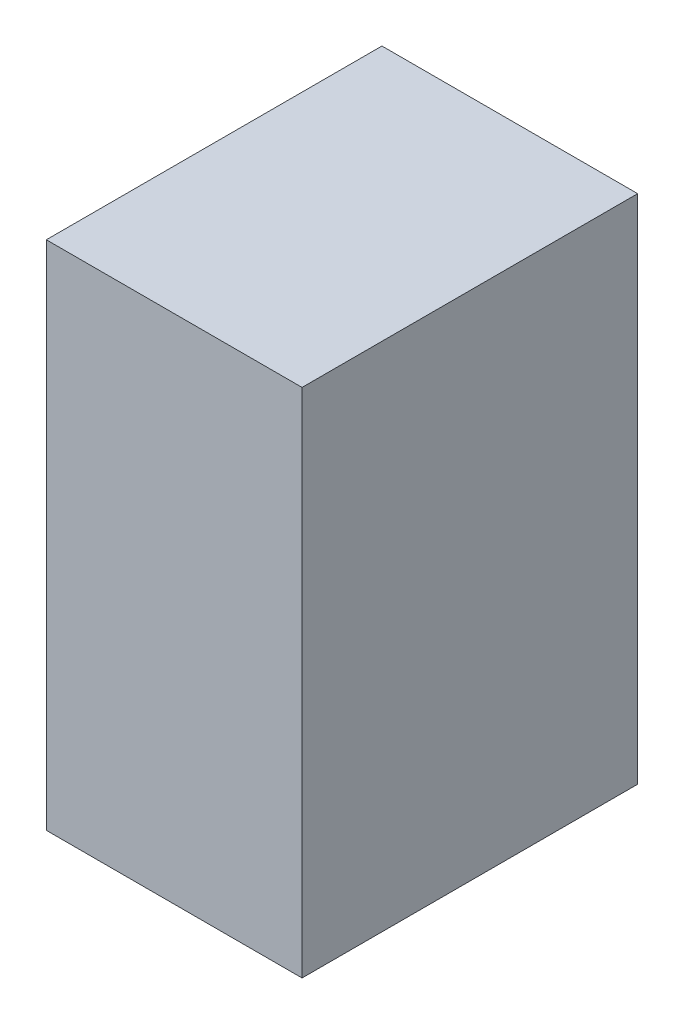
ISO-10303-21;
HEADER;
FILE_DESCRIPTION(('STEP AP214'),'2;1');
FILE_NAME('part.step','',(''),(''),'','','');
FILE_SCHEMA(('AUTOMOTIVE_DESIGN { 1 0 10303 214 1 1 1 1 }'));
ENDSEC;
DATA;
#1=APPLICATION_CONTEXT('core data for automotive mechanical design processes');
#2=APPLICATION_PROTOCOL_DEFINITION('international standard','automotive_design',2000,#1);
#3=PRODUCT_CONTEXT('',#1,'mechanical');
#4=PRODUCT('Part','Part','',(#3));
#5=PRODUCT_RELATED_PRODUCT_CATEGORY('part','',(#4));
#6=PRODUCT_DEFINITION_FORMATION('','',#4);
#7=PRODUCT_DEFINITION_CONTEXT('part definition',#1,'design');
#8=PRODUCT_DEFINITION('design','',#6,#7);
#9=PRODUCT_DEFINITION_SHAPE('','',#8);
#10=(LENGTH_UNIT() NAMED_UNIT(*) SI_UNIT(.MILLI.,.METRE.));
#11=(NAMED_UNIT(*) PLANE_ANGLE_UNIT() SI_UNIT($,.RADIAN.));
#12=(NAMED_UNIT(*) SI_UNIT($,.STERADIAN.) SOLID_ANGLE_UNIT());
#13=UNCERTAINTY_MEASURE_WITH_UNIT(LENGTH_MEASURE(1.E-05),#10,'distance_accuracy_value','');
#14=(GEOMETRIC_REPRESENTATION_CONTEXT(3) GLOBAL_UNCERTAINTY_ASSIGNED_CONTEXT((#13)) GLOBAL_UNIT_ASSIGNED_CONTEXT((#10,
#11,#12)) REPRESENTATION_CONTEXT('',''));
#15=CARTESIAN_POINT('',(0.,0.,0.));
#16=DIRECTION('',(0.,0.,1.));
#17=DIRECTION('',(1.,0.,0.));
#18=AXIS2_PLACEMENT_3D('',#15,#16,#17);
#19=CARTESIAN_POINT('',(0.,0.,0.499999));
#20=DIRECTION('',(0.,0.,-1.));
#21=DIRECTION('',(0.,-1.,0.));
#22=AXIS2_PLACEMENT_3D('',#19,#20,#21);
#23=PLANE('',#22);
#24=DIRECTION('',(0.,1.,0.));
#25=VECTOR('',#24,1.);
#26=CARTESIAN_POINT('',(-0.1905,-0.381,0.499999));
#27=LINE('',#26,#25);
#28=CARTESIAN_POINT('',(-0.1905,-0.381,0.499999));
#29=VERTEX_POINT('',#28);
#30=CARTESIAN_POINT('',(-0.1905,0.381,0.499999));
#31=VERTEX_POINT('',#30);
#32=EDGE_CURVE('E25',#29,#31,#27,.T.);
#33=ORIENTED_EDGE('',*,*,#32,.F.);
#34=DIRECTION('',(-1.,0.,0.));
#35=VECTOR('',#34,1.);
#36=CARTESIAN_POINT('',(0.1905,-0.381,0.499999));
#37=LINE('',#36,#35);
#38=CARTESIAN_POINT('',(0.1905,-0.381,0.499999));
#39=VERTEX_POINT('',#38);
#40=EDGE_CURVE('E97',#39,#29,#37,.T.);
#41=ORIENTED_EDGE('',*,*,#40,.F.);
#42=DIRECTION('',(0.,-1.,0.));
#43=VECTOR('',#42,1.);
#44=CARTESIAN_POINT('',(0.1905,0.381,0.499999));
#45=LINE('',#44,#43);
#46=CARTESIAN_POINT('',(0.1905,0.381,0.499999));
#47=VERTEX_POINT('',#46);
#48=EDGE_CURVE('E83',#47,#39,#45,.T.);
#49=ORIENTED_EDGE('',*,*,#48,.F.);
#50=DIRECTION('',(1.,0.,0.));
#51=VECTOR('',#50,1.);
#52=CARTESIAN_POINT('',(-0.1905,0.381,0.499999));
#53=LINE('',#52,#51);
#54=EDGE_CURVE('E87',#31,#47,#53,.T.);
#55=ORIENTED_EDGE('',*,*,#54,.F.);
#56=EDGE_LOOP('',(#33,#41,#49,#55));
#57=FACE_BOUND('',#56,.T.);
#58=ADVANCED_FACE('F17',(#57),#23,.F.);
#59=CARTESIAN_POINT('',(0.,0.,0.));
#60=DIRECTION('',(0.,0.,-1.));
#61=DIRECTION('',(0.,-1.,0.));
#62=AXIS2_PLACEMENT_3D('',#59,#60,#61);
#63=PLANE('',#62);
#64=DIRECTION('',(1.,0.,0.));
#65=VECTOR('',#64,1.);
#66=CARTESIAN_POINT('',(-0.1905,0.381,0.));
#67=LINE('',#66,#65);
#68=CARTESIAN_POINT('',(-0.1905,0.381,0.));
#69=VERTEX_POINT('',#68);
#70=CARTESIAN_POINT('',(0.1905,0.381,0.));
#71=VERTEX_POINT('',#70);
#72=EDGE_CURVE('E71',#69,#71,#67,.T.);
#73=ORIENTED_EDGE('',*,*,#72,.T.);
#74=DIRECTION('',(0.,-1.,0.));
#75=VECTOR('',#74,1.);
#76=CARTESIAN_POINT('',(0.1905,0.381,0.));
#77=LINE('',#76,#75);
#78=CARTESIAN_POINT('',(0.1905,-0.381,0.));
#79=VERTEX_POINT('',#78);
#80=EDGE_CURVE('E95',#71,#79,#77,.T.);
#81=ORIENTED_EDGE('',*,*,#80,.T.);
#82=DIRECTION('',(-1.,0.,0.));
#83=VECTOR('',#82,1.);
#84=CARTESIAN_POINT('',(0.1905,-0.381,0.));
#85=LINE('',#84,#83);
#86=CARTESIAN_POINT('',(-0.1905,-0.381,0.));
#87=VERTEX_POINT('',#86);
#88=EDGE_CURVE('E73',#79,#87,#85,.T.);
#89=ORIENTED_EDGE('',*,*,#88,.T.);
#90=DIRECTION('',(0.,1.,0.));
#91=VECTOR('',#90,1.);
#92=CARTESIAN_POINT('',(-0.1905,-0.381,0.));
#93=LINE('',#92,#91);
#94=EDGE_CURVE('E11',#87,#69,#93,.T.);
#95=ORIENTED_EDGE('',*,*,#94,.T.);
#96=EDGE_LOOP('',(#73,#81,#89,#95));
#97=FACE_BOUND('',#96,.T.);
#98=ADVANCED_FACE('F69',(#97),#63,.T.);
#99=CARTESIAN_POINT('',(-0.1905,-0.381,0.));
#100=DIRECTION('',(-1.,0.,0.));
#101=DIRECTION('',(0.,0.,1.));
#102=AXIS2_PLACEMENT_3D('',#99,#100,#101);
#103=PLANE('',#102);
#104=DIRECTION('',(0.,0.,1.));
#105=VECTOR('',#104,1.);
#106=CARTESIAN_POINT('',(-0.1905,-0.381,0.));
#107=LINE('',#106,#105);
#108=EDGE_CURVE('E105',#87,#29,#107,.T.);
#109=ORIENTED_EDGE('',*,*,#108,.T.);
#110=ORIENTED_EDGE('',*,*,#32,.T.);
#111=DIRECTION('',(0.,0.,1.));
#112=VECTOR('',#111,1.);
#113=CARTESIAN_POINT('',(-0.1905,0.381,0.));
#114=LINE('',#113,#112);
#115=EDGE_CURVE('E79',#69,#31,#114,.T.);
#116=ORIENTED_EDGE('',*,*,#115,.F.);
#117=ORIENTED_EDGE('',*,*,#94,.F.);
#118=EDGE_LOOP('',(#109,#110,#116,#117));
#119=FACE_BOUND('',#118,.T.);
#120=ADVANCED_FACE('F85',(#119),#103,.T.);
#121=CARTESIAN_POINT('',(0.1905,-0.381,0.));
#122=DIRECTION('',(0.,-1.,0.));
#123=DIRECTION('',(0.,0.,-1.));
#124=AXIS2_PLACEMENT_3D('',#121,#122,#123);
#125=PLANE('',#124);
#126=DIRECTION('',(0.,0.,1.));
#127=VECTOR('',#126,1.);
#128=CARTESIAN_POINT('',(0.1905,-0.381,0.));
#129=LINE('',#128,#127);
#130=EDGE_CURVE('E98',#79,#39,#129,.T.);
#131=ORIENTED_EDGE('',*,*,#130,.T.);
#132=ORIENTED_EDGE('',*,*,#40,.T.);
#133=ORIENTED_EDGE('',*,*,#108,.F.);
#134=ORIENTED_EDGE('',*,*,#88,.F.);
#135=EDGE_LOOP('',(#131,#132,#133,#134));
#136=FACE_BOUND('',#135,.T.);
#137=ADVANCED_FACE('F170',(#136),#125,.T.);
#138=CARTESIAN_POINT('',(0.1905,0.381,0.));
#139=DIRECTION('',(1.,0.,0.));
#140=DIRECTION('',(0.,1.,0.));
#141=AXIS2_PLACEMENT_3D('',#138,#139,#140);
#142=PLANE('',#141);
#143=DIRECTION('',(0.,0.,1.));
#144=VECTOR('',#143,1.);
#145=CARTESIAN_POINT('',(0.1905,0.381,0.));
#146=LINE('',#145,#144);
#147=EDGE_CURVE('E81',#71,#47,#146,.T.);
#148=ORIENTED_EDGE('',*,*,#147,.T.);
#149=ORIENTED_EDGE('',*,*,#48,.T.);
#150=ORIENTED_EDGE('',*,*,#130,.F.);
#151=ORIENTED_EDGE('',*,*,#80,.F.);
#152=EDGE_LOOP('',(#148,#149,#150,#151));
#153=FACE_BOUND('',#152,.T.);
#154=ADVANCED_FACE('F160',(#153),#142,.T.);
#155=CARTESIAN_POINT('',(-0.1905,0.381,0.));
#156=DIRECTION('',(0.,1.,0.));
#157=DIRECTION('',(1.,0.,0.));
#158=AXIS2_PLACEMENT_3D('',#155,#156,#157);
#159=PLANE('',#158);
#160=ORIENTED_EDGE('',*,*,#115,.T.);
#161=ORIENTED_EDGE('',*,*,#54,.T.);
#162=ORIENTED_EDGE('',*,*,#147,.F.);
#163=ORIENTED_EDGE('',*,*,#72,.F.);
#164=EDGE_LOOP('',(#160,#161,#162,#163));
#165=FACE_BOUND('',#164,.T.);
#166=ADVANCED_FACE('F77',(#165),#159,.T.);
#167=CLOSED_SHELL('',(#58,#98,#120,#137,#154,#166));
#168=MANIFOLD_SOLID_BREP('B1',#167);
#169=ADVANCED_BREP_SHAPE_REPRESENTATION('',(#18,#168),#14);
#170=SHAPE_DEFINITION_REPRESENTATION(#9,#169);
ENDSEC;
END-ISO-10303-21;
